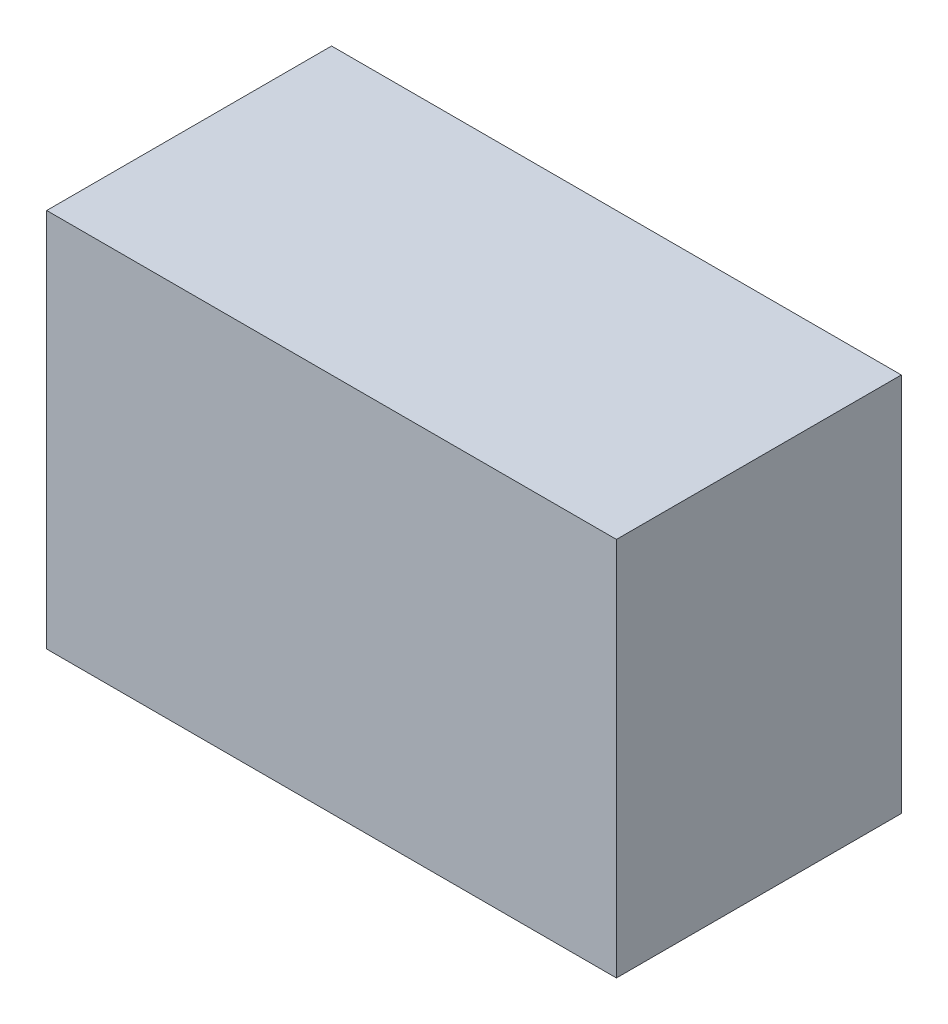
ISO-10303-21;
HEADER;
FILE_DESCRIPTION(('STEP AP214'),'2;1');
FILE_NAME('part.step','',(''),(''),'','','');
FILE_SCHEMA(('AUTOMOTIVE_DESIGN { 1 0 10303 214 1 1 1 1 }'));
ENDSEC;
DATA;
#1=APPLICATION_CONTEXT('core data for automotive mechanical design processes');
#2=APPLICATION_PROTOCOL_DEFINITION('international standard','automotive_design',2000,#1);
#3=PRODUCT_CONTEXT('',#1,'mechanical');
#4=PRODUCT('Part','Part','',(#3));
#5=PRODUCT_RELATED_PRODUCT_CATEGORY('part','',(#4));
#6=PRODUCT_DEFINITION_FORMATION('','',#4);
#7=PRODUCT_DEFINITION_CONTEXT('part definition',#1,'design');
#8=PRODUCT_DEFINITION('design','',#6,#7);
#9=PRODUCT_DEFINITION_SHAPE('','',#8);
#10=(LENGTH_UNIT() NAMED_UNIT(*) SI_UNIT(.MILLI.,.METRE.));
#11=(NAMED_UNIT(*) PLANE_ANGLE_UNIT() SI_UNIT($,.RADIAN.));
#12=(NAMED_UNIT(*) SI_UNIT($,.STERADIAN.) SOLID_ANGLE_UNIT());
#13=UNCERTAINTY_MEASURE_WITH_UNIT(LENGTH_MEASURE(1.E-05),#10,'distance_accuracy_value','');
#14=(GEOMETRIC_REPRESENTATION_CONTEXT(3) GLOBAL_UNCERTAINTY_ASSIGNED_CONTEXT((#13)) GLOBAL_UNIT_ASSIGNED_CONTEXT((#10,
#11,#12)) REPRESENTATION_CONTEXT('',''));
#15=CARTESIAN_POINT('',(0.,0.,0.));
#16=DIRECTION('',(0.,0.,1.));
#17=DIRECTION('',(1.,0.,0.));
#18=AXIS2_PLACEMENT_3D('',#15,#16,#17);
#19=CARTESIAN_POINT('',(135.,0.,22.5));
#20=DIRECTION('',(1.,0.,0.));
#21=DIRECTION('',(0.,0.,-1.));
#22=AXIS2_PLACEMENT_3D('',#19,#20,#21);
#23=PLANE('',#22);
#24=DIRECTION('',(0.,-1.,0.));
#25=VECTOR('',#24,1.);
#26=CARTESIAN_POINT('',(135.,0.,0.));
#27=LINE('',#26,#25);
#28=CARTESIAN_POINT('',(135.,0.,0.));
#29=VERTEX_POINT('',#28);
#30=CARTESIAN_POINT('',(135.,-30.,0.));
#31=VERTEX_POINT('',#30);
#32=EDGE_CURVE('E70',#29,#31,#27,.T.);
#33=ORIENTED_EDGE('',*,*,#32,.T.);
#34=DIRECTION('',(0.,0.,-1.));
#35=VECTOR('',#34,1.);
#36=CARTESIAN_POINT('',(135.,-30.,22.5));
#37=LINE('',#36,#35);
#38=CARTESIAN_POINT('',(135.,-30.,22.5));
#39=VERTEX_POINT('',#38);
#40=EDGE_CURVE('E11',#39,#31,#37,.T.);
#41=ORIENTED_EDGE('',*,*,#40,.F.);
#42=DIRECTION('',(0.,-1.,0.));
#43=VECTOR('',#42,1.);
#44=CARTESIAN_POINT('',(135.,0.,22.5));
#45=LINE('',#44,#43);
#46=CARTESIAN_POINT('',(135.,0.,22.5));
#47=VERTEX_POINT('',#46);
#48=EDGE_CURVE('E88',#47,#39,#45,.T.);
#49=ORIENTED_EDGE('',*,*,#48,.F.);
#50=DIRECTION('',(0.,0.,-1.));
#51=VECTOR('',#50,1.);
#52=CARTESIAN_POINT('',(135.,0.,22.5));
#53=LINE('',#52,#51);
#54=EDGE_CURVE('E82',#47,#29,#53,.T.);
#55=ORIENTED_EDGE('',*,*,#54,.T.);
#56=EDGE_LOOP('',(#33,#41,#49,#55));
#57=FACE_BOUND('',#56,.T.);
#58=ADVANCED_FACE('F26',(#57),#23,.F.);
#59=CARTESIAN_POINT('',(135.,-30.,22.5));
#60=DIRECTION('',(0.,1.,0.));
#61=DIRECTION('',(0.,0.,1.));
#62=AXIS2_PLACEMENT_3D('',#59,#60,#61);
#63=PLANE('',#62);
#64=DIRECTION('',(1.,0.,0.));
#65=VECTOR('',#64,1.);
#66=CARTESIAN_POINT('',(135.,-30.,0.));
#67=LINE('',#66,#65);
#68=CARTESIAN_POINT('',(180.,-30.,0.));
#69=VERTEX_POINT('',#68);
#70=EDGE_CURVE('E66',#31,#69,#67,.T.);
#71=ORIENTED_EDGE('',*,*,#70,.T.);
#72=DIRECTION('',(0.,0.,-1.));
#73=VECTOR('',#72,1.);
#74=CARTESIAN_POINT('',(180.,-30.,22.5));
#75=LINE('',#74,#73);
#76=CARTESIAN_POINT('',(180.,-30.,22.5));
#77=VERTEX_POINT('',#76);
#78=EDGE_CURVE('E33',#77,#69,#75,.T.);
#79=ORIENTED_EDGE('',*,*,#78,.F.);
#80=DIRECTION('',(1.,0.,0.));
#81=VECTOR('',#80,1.);
#82=CARTESIAN_POINT('',(135.,-30.,22.5));
#83=LINE('',#82,#81);
#84=EDGE_CURVE('E78',#39,#77,#83,.T.);
#85=ORIENTED_EDGE('',*,*,#84,.F.);
#86=ORIENTED_EDGE('',*,*,#40,.T.);
#87=EDGE_LOOP('',(#71,#79,#85,#86));
#88=FACE_BOUND('',#87,.T.);
#89=ADVANCED_FACE('F77',(#88),#63,.F.);
#90=CARTESIAN_POINT('',(180.,0.,22.5));
#91=DIRECTION('',(-1.,0.,0.));
#92=DIRECTION('',(0.,0.,1.));
#93=AXIS2_PLACEMENT_3D('',#90,#91,#92);
#94=PLANE('',#93);
#95=DIRECTION('',(0.,1.,0.));
#96=VECTOR('',#95,1.);
#97=CARTESIAN_POINT('',(180.,0.,0.));
#98=LINE('',#97,#96);
#99=CARTESIAN_POINT('',(180.,0.,0.));
#100=VERTEX_POINT('',#99);
#101=EDGE_CURVE('E71',#69,#100,#98,.T.);
#102=ORIENTED_EDGE('',*,*,#101,.T.);
#103=DIRECTION('',(0.,0.,-1.));
#104=VECTOR('',#103,1.);
#105=CARTESIAN_POINT('',(180.,0.,22.5));
#106=LINE('',#105,#104);
#107=CARTESIAN_POINT('',(180.,0.,22.5));
#108=VERTEX_POINT('',#107);
#109=EDGE_CURVE('E94',#108,#100,#106,.T.);
#110=ORIENTED_EDGE('',*,*,#109,.F.);
#111=DIRECTION('',(0.,1.,0.));
#112=VECTOR('',#111,1.);
#113=CARTESIAN_POINT('',(180.,0.,22.5));
#114=LINE('',#113,#112);
#115=EDGE_CURVE('E45',#77,#108,#114,.T.);
#116=ORIENTED_EDGE('',*,*,#115,.F.);
#117=ORIENTED_EDGE('',*,*,#78,.T.);
#118=EDGE_LOOP('',(#102,#110,#116,#117));
#119=FACE_BOUND('',#118,.T.);
#120=ADVANCED_FACE('F97',(#119),#94,.F.);
#121=CARTESIAN_POINT('',(135.,0.,22.5));
#122=DIRECTION('',(0.,-1.,0.));
#123=DIRECTION('',(0.,0.,-1.));
#124=AXIS2_PLACEMENT_3D('',#121,#122,#123);
#125=PLANE('',#124);
#126=DIRECTION('',(-1.,0.,0.));
#127=VECTOR('',#126,1.);
#128=CARTESIAN_POINT('',(135.,0.,0.));
#129=LINE('',#128,#127);
#130=EDGE_CURVE('E86',#100,#29,#129,.T.);
#131=ORIENTED_EDGE('',*,*,#130,.T.);
#132=ORIENTED_EDGE('',*,*,#54,.F.);
#133=DIRECTION('',(-1.,0.,0.));
#134=VECTOR('',#133,1.);
#135=CARTESIAN_POINT('',(135.,0.,22.5));
#136=LINE('',#135,#134);
#137=EDGE_CURVE('E40',#108,#47,#136,.T.);
#138=ORIENTED_EDGE('',*,*,#137,.F.);
#139=ORIENTED_EDGE('',*,*,#109,.T.);
#140=EDGE_LOOP('',(#131,#132,#138,#139));
#141=FACE_BOUND('',#140,.T.);
#142=ADVANCED_FACE('F99',(#141),#125,.F.);
#143=CARTESIAN_POINT('',(135.,-30.,22.5));
#144=DIRECTION('',(0.,0.,1.));
#145=DIRECTION('',(1.,0.,0.));
#146=AXIS2_PLACEMENT_3D('',#143,#144,#145);
#147=PLANE('',#146);
#148=ORIENTED_EDGE('',*,*,#48,.T.);
#149=ORIENTED_EDGE('',*,*,#84,.T.);
#150=ORIENTED_EDGE('',*,*,#115,.T.);
#151=ORIENTED_EDGE('',*,*,#137,.T.);
#152=EDGE_LOOP('',(#148,#149,#150,#151));
#153=FACE_BOUND('',#152,.T.);
#154=ADVANCED_FACE('F100',(#153),#147,.T.);
#155=CARTESIAN_POINT('',(135.,-30.,0.));
#156=DIRECTION('',(0.,0.,1.));
#157=DIRECTION('',(1.,0.,0.));
#158=AXIS2_PLACEMENT_3D('',#155,#156,#157);
#159=PLANE('',#158);
#160=ORIENTED_EDGE('',*,*,#32,.F.);
#161=ORIENTED_EDGE('',*,*,#130,.F.);
#162=ORIENTED_EDGE('',*,*,#101,.F.);
#163=ORIENTED_EDGE('',*,*,#70,.F.);
#164=EDGE_LOOP('',(#160,#161,#162,#163));
#165=FACE_BOUND('',#164,.T.);
#166=ADVANCED_FACE('F67',(#165),#159,.F.);
#167=CLOSED_SHELL('',(#58,#89,#120,#142,#154,#166));
#168=MANIFOLD_SOLID_BREP('B2',#167);
#169=ADVANCED_BREP_SHAPE_REPRESENTATION('',(#18,#168),#14);
#170=SHAPE_DEFINITION_REPRESENTATION(#9,#169);
ENDSEC;
END-ISO-10303-21;
